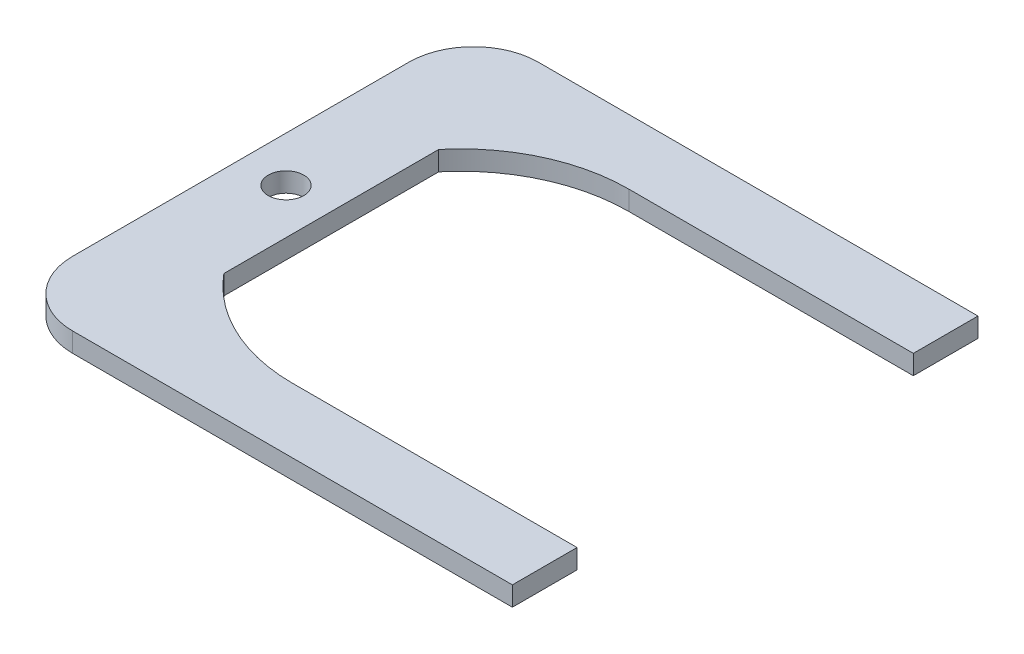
from build123d import *

# Parameters (mm, degrees)
SKETCH1_R      = 2.75
EXTRUDE1_DEPTH = 3


with BuildPart() as part:
    # Sketch1 → Extrude1 (new body)
    with BuildSketch(Plane(origin=(0, 0, 0), x_dir=(1, 0, 0), z_dir=(0, 1, 0))):
        with BuildLine():
            Line((-7, -26), (-7, 26))
            ThreePointArc((-7, 26), (-4.071067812, 33.071067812), (3, 36))
            Line((3, 36), (71, 36))
            Line((71, 36), (71, 26))
            Line((71, 26), (27, 26))
            ThreePointArc((27, 26), (15.953381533, 23.536614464), (7, 16.613247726))
            Line((7, 16.613247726), (7, -16.613247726))
            ThreePointArc((7, -16.613247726), (15.953381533, -23.536614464), (27, -26))
            Line((27, -26), (71, -26))
            Line((71, -26), (71, -36))
            Line((71, -36), (3, -36))
            ThreePointArc((3, -36), (-4.071067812, -33.071067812), (-7, -26))
        make_face()
        with Locations(Location((0, 0, 0), (0, 0, 270))):
            Circle(SKETCH1_R, mode=Mode.SUBTRACT)
    extrude(amount=EXTRUDE1_DEPTH)


solid = part.part
